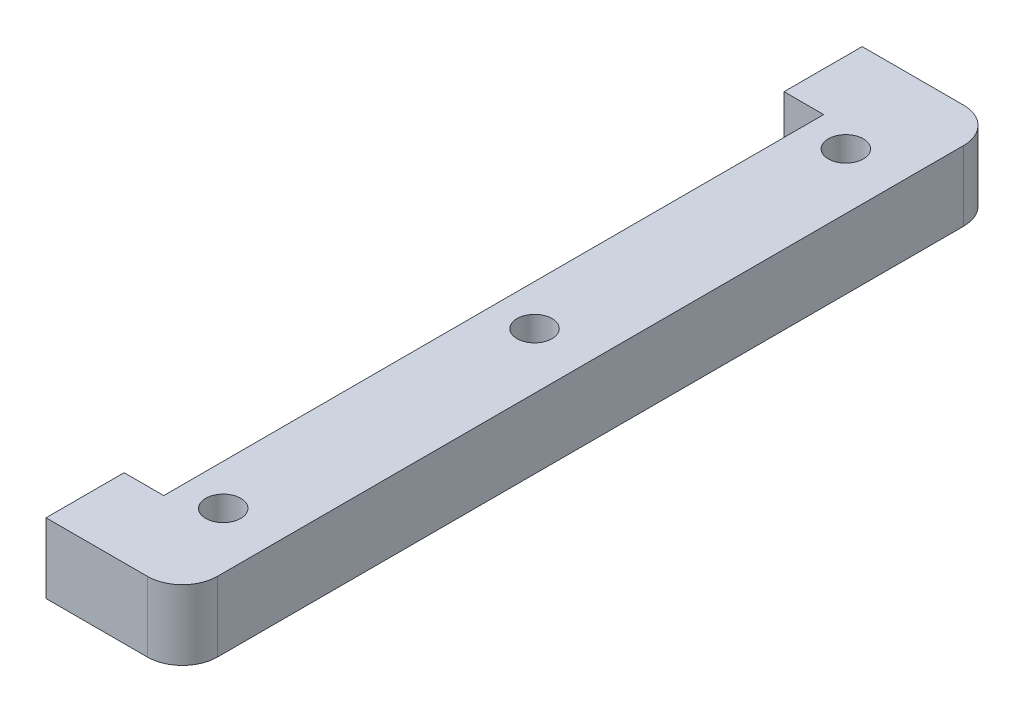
ISO-10303-21;
HEADER;
FILE_DESCRIPTION(('STEP AP214'),'2;1');
FILE_NAME('part.step','',(''),(''),'','','');
FILE_SCHEMA(('AUTOMOTIVE_DESIGN { 1 0 10303 214 1 1 1 1 }'));
ENDSEC;
DATA;
#1=APPLICATION_CONTEXT('core data for automotive mechanical design processes');
#2=APPLICATION_PROTOCOL_DEFINITION('international standard','automotive_design',2000,#1);
#3=PRODUCT_CONTEXT('',#1,'mechanical');
#4=PRODUCT('Part','Part','',(#3));
#5=PRODUCT_RELATED_PRODUCT_CATEGORY('part','',(#4));
#6=PRODUCT_DEFINITION_FORMATION('','',#4);
#7=PRODUCT_DEFINITION_CONTEXT('part definition',#1,'design');
#8=PRODUCT_DEFINITION('design','',#6,#7);
#9=PRODUCT_DEFINITION_SHAPE('','',#8);
#10=(LENGTH_UNIT() NAMED_UNIT(*) SI_UNIT(.MILLI.,.METRE.));
#11=(NAMED_UNIT(*) PLANE_ANGLE_UNIT() SI_UNIT($,.RADIAN.));
#12=(NAMED_UNIT(*) SI_UNIT($,.STERADIAN.) SOLID_ANGLE_UNIT());
#13=UNCERTAINTY_MEASURE_WITH_UNIT(LENGTH_MEASURE(1.E-05),#10,'distance_accuracy_value','');
#14=(GEOMETRIC_REPRESENTATION_CONTEXT(3) GLOBAL_UNCERTAINTY_ASSIGNED_CONTEXT((#13)) GLOBAL_UNIT_ASSIGNED_CONTEXT((#10,
#11,#12)) REPRESENTATION_CONTEXT('',''));
#15=CARTESIAN_POINT('',(0.,0.,0.));
#16=DIRECTION('',(0.,0.,1.));
#17=DIRECTION('',(1.,0.,0.));
#18=AXIS2_PLACEMENT_3D('',#15,#16,#17);
#19=CARTESIAN_POINT('',(0.,3.,0.));
#20=DIRECTION('',(0.,1.,0.));
#21=DIRECTION('',(0.,0.,1.));
#22=AXIS2_PLACEMENT_3D('',#19,#20,#21);
#23=PLANE('',#22);
#24=CARTESIAN_POINT('',(14.,3.,26.7));
#25=DIRECTION('',(0.,1.,0.));
#26=DIRECTION('',(0.,0.,1.));
#27=AXIS2_PLACEMENT_3D('',#24,#25,#26);
#28=CIRCLE('',#27,1.5);
#29=CARTESIAN_POINT('',(14.,3.,28.2));
#30=VERTEX_POINT('',#29);
#31=EDGE_CURVE('E163',#30,#30,#28,.F.);
#32=ORIENTED_EDGE('',*,*,#31,.T.);
#33=EDGE_LOOP('',(#32));
#34=FACE_BOUND('',#33,.T.);
#35=CARTESIAN_POINT('',(14.,3.,0.));
#36=DIRECTION('',(0.,1.,0.));
#37=DIRECTION('',(0.,0.,1.));
#38=AXIS2_PLACEMENT_3D('',#35,#36,#37);
#39=CIRCLE('',#38,1.5);
#40=CARTESIAN_POINT('',(14.,3.,1.5));
#41=VERTEX_POINT('',#40);
#42=EDGE_CURVE('E166',#41,#41,#39,.F.);
#43=ORIENTED_EDGE('',*,*,#42,.T.);
#44=EDGE_LOOP('',(#43));
#45=FACE_BOUND('',#44,.T.);
#46=CARTESIAN_POINT('',(14.,3.,-26.7));
#47=DIRECTION('',(0.,1.,0.));
#48=DIRECTION('',(0.,0.,1.));
#49=AXIS2_PLACEMENT_3D('',#46,#47,#48);
#50=CIRCLE('',#49,1.5);
#51=CARTESIAN_POINT('',(14.,3.,-25.2));
#52=VERTEX_POINT('',#51);
#53=EDGE_CURVE('E169',#52,#52,#50,.F.);
#54=ORIENTED_EDGE('',*,*,#53,.T.);
#55=EDGE_LOOP('',(#54));
#56=FACE_BOUND('',#55,.T.);
#57=DIRECTION('',(1.,0.,0.));
#58=VECTOR('',#57,1.);
#59=CARTESIAN_POINT('',(7.1,3.,35.));
#60=LINE('',#59,#58);
#61=CARTESIAN_POINT('',(15.8,3.,35.));
#62=VERTEX_POINT('',#61);
#63=CARTESIAN_POINT('',(7.1,3.,35.));
#64=VERTEX_POINT('',#63);
#65=EDGE_CURVE('E105',#62,#64,#60,.F.);
#66=ORIENTED_EDGE('',*,*,#65,.F.);
#67=CARTESIAN_POINT('',(15.8,3.,32.));
#68=DIRECTION('',(0.,1.,0.));
#69=DIRECTION('',(0.,0.,1.));
#70=AXIS2_PLACEMENT_3D('',#67,#68,#69);
#71=CIRCLE('',#70,3.);
#72=CARTESIAN_POINT('',(18.8,3.,32.));
#73=VERTEX_POINT('',#72);
#74=EDGE_CURVE('E20',#73,#62,#71,.F.);
#75=ORIENTED_EDGE('',*,*,#74,.F.);
#76=DIRECTION('',(0.,0.,-1.));
#77=VECTOR('',#76,1.);
#78=CARTESIAN_POINT('',(18.8,3.,32.));
#79=LINE('',#78,#77);
#80=CARTESIAN_POINT('',(18.8,3.,-32.));
#81=VERTEX_POINT('',#80);
#82=EDGE_CURVE('E91',#81,#73,#79,.F.);
#83=ORIENTED_EDGE('',*,*,#82,.F.);
#84=CARTESIAN_POINT('',(15.8,3.,-32.));
#85=DIRECTION('',(0.,1.,0.));
#86=DIRECTION('',(0.,0.,1.));
#87=AXIS2_PLACEMENT_3D('',#84,#85,#86);
#88=CIRCLE('',#87,3.);
#89=CARTESIAN_POINT('',(15.8,3.,-35.));
#90=VERTEX_POINT('',#89);
#91=EDGE_CURVE('E112',#90,#81,#88,.F.);
#92=ORIENTED_EDGE('',*,*,#91,.F.);
#93=DIRECTION('',(-1.,0.,0.));
#94=VECTOR('',#93,1.);
#95=CARTESIAN_POINT('',(15.8,3.,-35.));
#96=LINE('',#95,#94);
#97=CARTESIAN_POINT('',(7.1,3.,-35.));
#98=VERTEX_POINT('',#97);
#99=EDGE_CURVE('E147',#98,#90,#96,.F.);
#100=ORIENTED_EDGE('',*,*,#99,.F.);
#101=DIRECTION('',(0.,0.,1.));
#102=VECTOR('',#101,1.);
#103=CARTESIAN_POINT('',(7.1,3.,-35.));
#104=LINE('',#103,#102);
#105=CARTESIAN_POINT('',(7.1,3.,-28.3));
#106=VERTEX_POINT('',#105);
#107=EDGE_CURVE('E142',#106,#98,#104,.F.);
#108=ORIENTED_EDGE('',*,*,#107,.F.);
#109=DIRECTION('',(1.,0.,0.));
#110=VECTOR('',#109,1.);
#111=CARTESIAN_POINT('',(7.1,3.,-28.3));
#112=LINE('',#111,#110);
#113=CARTESIAN_POINT('',(10.5,3.,-28.3));
#114=VERTEX_POINT('',#113);
#115=EDGE_CURVE('E137',#114,#106,#112,.F.);
#116=ORIENTED_EDGE('',*,*,#115,.F.);
#117=DIRECTION('',(0.,0.,1.));
#118=VECTOR('',#117,1.);
#119=CARTESIAN_POINT('',(10.5,3.,-28.3));
#120=LINE('',#119,#118);
#121=CARTESIAN_POINT('',(10.5,3.,28.3));
#122=VERTEX_POINT('',#121);
#123=EDGE_CURVE('E132',#122,#114,#120,.F.);
#124=ORIENTED_EDGE('',*,*,#123,.F.);
#125=DIRECTION('',(-1.,0.,0.));
#126=VECTOR('',#125,1.);
#127=CARTESIAN_POINT('',(10.5,3.,28.3));
#128=LINE('',#127,#126);
#129=CARTESIAN_POINT('',(7.1,3.,28.3));
#130=VERTEX_POINT('',#129);
#131=EDGE_CURVE('E127',#130,#122,#128,.F.);
#132=ORIENTED_EDGE('',*,*,#131,.F.);
#133=DIRECTION('',(0.,0.,1.));
#134=VECTOR('',#133,1.);
#135=CARTESIAN_POINT('',(7.1,3.,28.3));
#136=LINE('',#135,#134);
#137=EDGE_CURVE('E117',#64,#130,#136,.F.);
#138=ORIENTED_EDGE('',*,*,#137,.F.);
#139=EDGE_LOOP('',(#66,#75,#83,#92,#100,#108,#116,#124,#132,#138));
#140=FACE_BOUND('',#139,.T.);
#141=ADVANCED_FACE('F17',(#34,#45,#56,#140),#23,.T.);
#142=CARTESIAN_POINT('',(15.8,-3.,32.));
#143=DIRECTION('',(0.,1.,0.));
#144=DIRECTION('',(0.,0.,1.));
#145=AXIS2_PLACEMENT_3D('',#142,#143,#144);
#146=CYLINDRICAL_SURFACE('',#145,3.);
#147=DIRECTION('',(0.,1.,0.));
#148=VECTOR('',#147,1.);
#149=CARTESIAN_POINT('',(15.8,-3.,35.));
#150=LINE('',#149,#148);
#151=CARTESIAN_POINT('',(15.8,-3.,35.));
#152=VERTEX_POINT('',#151);
#153=EDGE_CURVE('E124',#152,#62,#150,.T.);
#154=ORIENTED_EDGE('',*,*,#153,.F.);
#155=CARTESIAN_POINT('',(15.8,-3.,32.));
#156=DIRECTION('',(0.,1.,0.));
#157=DIRECTION('',(0.,0.,1.));
#158=AXIS2_PLACEMENT_3D('',#155,#156,#157);
#159=CIRCLE('',#158,3.);
#160=CARTESIAN_POINT('',(18.8,-3.,32.));
#161=VERTEX_POINT('',#160);
#162=EDGE_CURVE('E111',#152,#161,#159,.T.);
#163=ORIENTED_EDGE('',*,*,#162,.T.);
#164=DIRECTION('',(0.,1.,0.));
#165=VECTOR('',#164,1.);
#166=CARTESIAN_POINT('',(18.8,-3.,32.));
#167=LINE('',#166,#165);
#168=EDGE_CURVE('E96',#73,#161,#167,.F.);
#169=ORIENTED_EDGE('',*,*,#168,.F.);
#170=ORIENTED_EDGE('',*,*,#74,.T.);
#171=EDGE_LOOP('',(#154,#163,#169,#170));
#172=FACE_BOUND('',#171,.T.);
#173=ADVANCED_FACE('F110',(#172),#146,.T.);
#174=CARTESIAN_POINT('',(18.8,-3.,32.));
#175=DIRECTION('',(1.,0.,0.));
#176=DIRECTION('',(0.,0.,-1.));
#177=AXIS2_PLACEMENT_3D('',#174,#175,#176);
#178=PLANE('',#177);
#179=ORIENTED_EDGE('',*,*,#168,.T.);
#180=DIRECTION('',(0.,0.,1.));
#181=VECTOR('',#180,1.);
#182=CARTESIAN_POINT('',(18.8,-3.,0.));
#183=LINE('',#182,#181);
#184=CARTESIAN_POINT('',(18.8,-3.,-32.));
#185=VERTEX_POINT('',#184);
#186=EDGE_CURVE('E161',#161,#185,#183,.F.);
#187=ORIENTED_EDGE('',*,*,#186,.T.);
#188=DIRECTION('',(0.,1.,0.));
#189=VECTOR('',#188,1.);
#190=CARTESIAN_POINT('',(18.8,-3.,-32.));
#191=LINE('',#190,#189);
#192=EDGE_CURVE('E98',#81,#185,#191,.F.);
#193=ORIENTED_EDGE('',*,*,#192,.F.);
#194=ORIENTED_EDGE('',*,*,#82,.T.);
#195=EDGE_LOOP('',(#179,#187,#193,#194));
#196=FACE_BOUND('',#195,.T.);
#197=ADVANCED_FACE('F93',(#196),#178,.T.);
#198=CARTESIAN_POINT('',(15.8,-3.,-32.));
#199=DIRECTION('',(0.,1.,0.));
#200=DIRECTION('',(0.,0.,1.));
#201=AXIS2_PLACEMENT_3D('',#198,#199,#200);
#202=CYLINDRICAL_SURFACE('',#201,3.);
#203=ORIENTED_EDGE('',*,*,#192,.T.);
#204=CARTESIAN_POINT('',(15.8,-3.,-32.));
#205=DIRECTION('',(0.,1.,0.));
#206=DIRECTION('',(0.,0.,1.));
#207=AXIS2_PLACEMENT_3D('',#204,#205,#206);
#208=CIRCLE('',#207,3.);
#209=CARTESIAN_POINT('',(15.8,-3.,-35.));
#210=VERTEX_POINT('',#209);
#211=EDGE_CURVE('E157',#185,#210,#208,.T.);
#212=ORIENTED_EDGE('',*,*,#211,.T.);
#213=DIRECTION('',(0.,1.,0.));
#214=VECTOR('',#213,1.);
#215=CARTESIAN_POINT('',(15.8,-3.,-35.));
#216=LINE('',#215,#214);
#217=EDGE_CURVE('E144',#90,#210,#216,.F.);
#218=ORIENTED_EDGE('',*,*,#217,.F.);
#219=ORIENTED_EDGE('',*,*,#91,.T.);
#220=EDGE_LOOP('',(#203,#212,#218,#219));
#221=FACE_BOUND('',#220,.T.);
#222=ADVANCED_FACE('F233',(#221),#202,.T.);
#223=CARTESIAN_POINT('',(15.8,-3.,-35.));
#224=DIRECTION('',(0.,0.,-1.));
#225=DIRECTION('',(-1.,0.,0.));
#226=AXIS2_PLACEMENT_3D('',#223,#224,#225);
#227=PLANE('',#226);
#228=ORIENTED_EDGE('',*,*,#217,.T.);
#229=DIRECTION('',(1.,0.,0.));
#230=VECTOR('',#229,1.);
#231=CARTESIAN_POINT('',(0.,-3.,-35.));
#232=LINE('',#231,#230);
#233=CARTESIAN_POINT('',(7.1,-3.,-35.));
#234=VERTEX_POINT('',#233);
#235=EDGE_CURVE('E160',#210,#234,#232,.F.);
#236=ORIENTED_EDGE('',*,*,#235,.T.);
#237=DIRECTION('',(0.,1.,0.));
#238=VECTOR('',#237,1.);
#239=CARTESIAN_POINT('',(7.1,-3.,-35.));
#240=LINE('',#239,#238);
#241=EDGE_CURVE('E139',#98,#234,#240,.F.);
#242=ORIENTED_EDGE('',*,*,#241,.F.);
#243=ORIENTED_EDGE('',*,*,#99,.T.);
#244=EDGE_LOOP('',(#228,#236,#242,#243));
#245=FACE_BOUND('',#244,.T.);
#246=ADVANCED_FACE('F222',(#245),#227,.T.);
#247=CARTESIAN_POINT('',(7.1,-3.,-35.));
#248=DIRECTION('',(-1.,0.,0.));
#249=DIRECTION('',(0.,0.,1.));
#250=AXIS2_PLACEMENT_3D('',#247,#248,#249);
#251=PLANE('',#250);
#252=ORIENTED_EDGE('',*,*,#241,.T.);
#253=DIRECTION('',(0.,0.,1.));
#254=VECTOR('',#253,1.);
#255=CARTESIAN_POINT('',(7.1,-3.,0.));
#256=LINE('',#255,#254);
#257=CARTESIAN_POINT('',(7.1,-3.,-28.3));
#258=VERTEX_POINT('',#257);
#259=EDGE_CURVE('E206',#234,#258,#256,.T.);
#260=ORIENTED_EDGE('',*,*,#259,.T.);
#261=DIRECTION('',(0.,1.,0.));
#262=VECTOR('',#261,1.);
#263=CARTESIAN_POINT('',(7.1,-3.,-28.3));
#264=LINE('',#263,#262);
#265=EDGE_CURVE('E134',#106,#258,#264,.F.);
#266=ORIENTED_EDGE('',*,*,#265,.F.);
#267=ORIENTED_EDGE('',*,*,#107,.T.);
#268=EDGE_LOOP('',(#252,#260,#266,#267));
#269=FACE_BOUND('',#268,.T.);
#270=ADVANCED_FACE('F238',(#269),#251,.T.);
#271=CARTESIAN_POINT('',(7.1,-3.,-28.3));
#272=DIRECTION('',(0.,0.,1.));
#273=DIRECTION('',(1.,0.,0.));
#274=AXIS2_PLACEMENT_3D('',#271,#272,#273);
#275=PLANE('',#274);
#276=ORIENTED_EDGE('',*,*,#265,.T.);
#277=DIRECTION('',(1.,0.,0.));
#278=VECTOR('',#277,1.);
#279=CARTESIAN_POINT('',(0.,-3.,-28.3));
#280=LINE('',#279,#278);
#281=CARTESIAN_POINT('',(10.5,-3.,-28.3));
#282=VERTEX_POINT('',#281);
#283=EDGE_CURVE('E198',#258,#282,#280,.T.);
#284=ORIENTED_EDGE('',*,*,#283,.T.);
#285=DIRECTION('',(0.,1.,0.));
#286=VECTOR('',#285,1.);
#287=CARTESIAN_POINT('',(10.5,-3.,-28.3));
#288=LINE('',#287,#286);
#289=EDGE_CURVE('E129',#114,#282,#288,.F.);
#290=ORIENTED_EDGE('',*,*,#289,.F.);
#291=ORIENTED_EDGE('',*,*,#115,.T.);
#292=EDGE_LOOP('',(#276,#284,#290,#291));
#293=FACE_BOUND('',#292,.T.);
#294=ADVANCED_FACE('F240',(#293),#275,.T.);
#295=CARTESIAN_POINT('',(10.5,-3.,-28.3));
#296=DIRECTION('',(-1.,0.,0.));
#297=DIRECTION('',(0.,0.,1.));
#298=AXIS2_PLACEMENT_3D('',#295,#296,#297);
#299=PLANE('',#298);
#300=ORIENTED_EDGE('',*,*,#289,.T.);
#301=DIRECTION('',(0.,0.,1.));
#302=VECTOR('',#301,1.);
#303=CARTESIAN_POINT('',(10.5,-3.,0.));
#304=LINE('',#303,#302);
#305=CARTESIAN_POINT('',(10.5,-3.,28.3));
#306=VERTEX_POINT('',#305);
#307=EDGE_CURVE('E190',#282,#306,#304,.T.);
#308=ORIENTED_EDGE('',*,*,#307,.T.);
#309=DIRECTION('',(0.,1.,0.));
#310=VECTOR('',#309,1.);
#311=CARTESIAN_POINT('',(10.5,-3.,28.3));
#312=LINE('',#311,#310);
#313=EDGE_CURVE('E120',#122,#306,#312,.F.);
#314=ORIENTED_EDGE('',*,*,#313,.F.);
#315=ORIENTED_EDGE('',*,*,#123,.T.);
#316=EDGE_LOOP('',(#300,#308,#314,#315));
#317=FACE_BOUND('',#316,.T.);
#318=ADVANCED_FACE('F246',(#317),#299,.T.);
#319=CARTESIAN_POINT('',(10.5,-3.,28.3));
#320=DIRECTION('',(0.,0.,-1.));
#321=DIRECTION('',(-1.,0.,0.));
#322=AXIS2_PLACEMENT_3D('',#319,#320,#321);
#323=PLANE('',#322);
#324=ORIENTED_EDGE('',*,*,#313,.T.);
#325=DIRECTION('',(1.,0.,0.));
#326=VECTOR('',#325,1.);
#327=CARTESIAN_POINT('',(0.,-3.,28.3));
#328=LINE('',#327,#326);
#329=CARTESIAN_POINT('',(7.1,-3.,28.3));
#330=VERTEX_POINT('',#329);
#331=EDGE_CURVE('E182',#306,#330,#328,.F.);
#332=ORIENTED_EDGE('',*,*,#331,.T.);
#333=DIRECTION('',(0.,1.,0.));
#334=VECTOR('',#333,1.);
#335=CARTESIAN_POINT('',(7.1,-3.,28.3));
#336=LINE('',#335,#334);
#337=EDGE_CURVE('E119',#130,#330,#336,.F.);
#338=ORIENTED_EDGE('',*,*,#337,.F.);
#339=ORIENTED_EDGE('',*,*,#131,.T.);
#340=EDGE_LOOP('',(#324,#332,#338,#339));
#341=FACE_BOUND('',#340,.T.);
#342=ADVANCED_FACE('F251',(#341),#323,.T.);
#343=CARTESIAN_POINT('',(7.1,-3.,28.3));
#344=DIRECTION('',(-1.,0.,0.));
#345=DIRECTION('',(0.,0.,1.));
#346=AXIS2_PLACEMENT_3D('',#343,#344,#345);
#347=PLANE('',#346);
#348=ORIENTED_EDGE('',*,*,#337,.T.);
#349=DIRECTION('',(0.,0.,1.));
#350=VECTOR('',#349,1.);
#351=CARTESIAN_POINT('',(7.1,-3.,0.));
#352=LINE('',#351,#350);
#353=CARTESIAN_POINT('',(7.1,-3.,35.));
#354=VERTEX_POINT('',#353);
#355=EDGE_CURVE('E179',#330,#354,#352,.T.);
#356=ORIENTED_EDGE('',*,*,#355,.T.);
#357=DIRECTION('',(0.,1.,0.));
#358=VECTOR('',#357,1.);
#359=CARTESIAN_POINT('',(7.1,-3.,35.));
#360=LINE('',#359,#358);
#361=EDGE_CURVE('E35',#64,#354,#360,.F.);
#362=ORIENTED_EDGE('',*,*,#361,.F.);
#363=ORIENTED_EDGE('',*,*,#137,.T.);
#364=EDGE_LOOP('',(#348,#356,#362,#363));
#365=FACE_BOUND('',#364,.T.);
#366=ADVANCED_FACE('F253',(#365),#347,.T.);
#367=CARTESIAN_POINT('',(7.1,-3.,35.));
#368=DIRECTION('',(0.,0.,1.));
#369=DIRECTION('',(1.,0.,0.));
#370=AXIS2_PLACEMENT_3D('',#367,#368,#369);
#371=PLANE('',#370);
#372=ORIENTED_EDGE('',*,*,#361,.T.);
#373=DIRECTION('',(1.,0.,0.));
#374=VECTOR('',#373,1.);
#375=CARTESIAN_POINT('',(0.,-3.,35.));
#376=LINE('',#375,#374);
#377=EDGE_CURVE('E156',#354,#152,#376,.T.);
#378=ORIENTED_EDGE('',*,*,#377,.T.);
#379=ORIENTED_EDGE('',*,*,#153,.T.);
#380=ORIENTED_EDGE('',*,*,#65,.T.);
#381=EDGE_LOOP('',(#372,#378,#379,#380));
#382=FACE_BOUND('',#381,.T.);
#383=ADVANCED_FACE('F259',(#382),#371,.T.);
#384=CARTESIAN_POINT('',(14.,-3.,-26.7));
#385=DIRECTION('',(0.,1.,0.));
#386=DIRECTION('',(0.,0.,1.));
#387=AXIS2_PLACEMENT_3D('',#384,#385,#386);
#388=CYLINDRICAL_SURFACE('',#387,1.5);
#389=ORIENTED_EDGE('',*,*,#53,.F.);
#390=EDGE_LOOP('',(#389));
#391=FACE_BOUND('',#390,.T.);
#392=CARTESIAN_POINT('',(14.,-3.,-26.7));
#393=DIRECTION('',(0.,1.,0.));
#394=DIRECTION('',(0.,0.,1.));
#395=AXIS2_PLACEMENT_3D('',#392,#393,#394);
#396=CIRCLE('',#395,1.5);
#397=CARTESIAN_POINT('',(14.,-3.,-25.2));
#398=VERTEX_POINT('',#397);
#399=EDGE_CURVE('E153',#398,#398,#396,.F.);
#400=ORIENTED_EDGE('',*,*,#399,.T.);
#401=EDGE_LOOP('',(#400));
#402=FACE_BOUND('',#401,.T.);
#403=ADVANCED_FACE('F261',(#391,#402),#388,.F.);
#404=CARTESIAN_POINT('',(14.,-3.,0.));
#405=DIRECTION('',(0.,1.,0.));
#406=DIRECTION('',(0.,0.,1.));
#407=AXIS2_PLACEMENT_3D('',#404,#405,#406);
#408=CYLINDRICAL_SURFACE('',#407,1.5);
#409=ORIENTED_EDGE('',*,*,#42,.F.);
#410=EDGE_LOOP('',(#409));
#411=FACE_BOUND('',#410,.T.);
#412=CARTESIAN_POINT('',(14.,-3.,0.));
#413=DIRECTION('',(0.,1.,0.));
#414=DIRECTION('',(0.,0.,1.));
#415=AXIS2_PLACEMENT_3D('',#412,#413,#414);
#416=CIRCLE('',#415,1.5);
#417=CARTESIAN_POINT('',(14.,-3.,1.5));
#418=VERTEX_POINT('',#417);
#419=EDGE_CURVE('E26',#418,#418,#416,.F.);
#420=ORIENTED_EDGE('',*,*,#419,.T.);
#421=EDGE_LOOP('',(#420));
#422=FACE_BOUND('',#421,.T.);
#423=ADVANCED_FACE('F268',(#411,#422),#408,.F.);
#424=CARTESIAN_POINT('',(14.,-3.,26.7));
#425=DIRECTION('',(0.,1.,0.));
#426=DIRECTION('',(0.,0.,1.));
#427=AXIS2_PLACEMENT_3D('',#424,#425,#426);
#428=CYLINDRICAL_SURFACE('',#427,1.5);
#429=ORIENTED_EDGE('',*,*,#31,.F.);
#430=EDGE_LOOP('',(#429));
#431=FACE_BOUND('',#430,.T.);
#432=CARTESIAN_POINT('',(14.,-3.,26.7));
#433=DIRECTION('',(0.,1.,0.));
#434=DIRECTION('',(0.,0.,1.));
#435=AXIS2_PLACEMENT_3D('',#432,#433,#434);
#436=CIRCLE('',#435,1.5);
#437=CARTESIAN_POINT('',(14.,-3.,28.2));
#438=VERTEX_POINT('',#437);
#439=EDGE_CURVE('E11',#438,#438,#436,.F.);
#440=ORIENTED_EDGE('',*,*,#439,.T.);
#441=EDGE_LOOP('',(#440));
#442=FACE_BOUND('',#441,.T.);
#443=ADVANCED_FACE('F273',(#431,#442),#428,.F.);
#444=CARTESIAN_POINT('',(0.,-3.,0.));
#445=DIRECTION('',(0.,1.,0.));
#446=DIRECTION('',(0.,0.,1.));
#447=AXIS2_PLACEMENT_3D('',#444,#445,#446);
#448=PLANE('',#447);
#449=ORIENTED_EDGE('',*,*,#439,.F.);
#450=EDGE_LOOP('',(#449));
#451=FACE_BOUND('',#450,.T.);
#452=ORIENTED_EDGE('',*,*,#419,.F.);
#453=EDGE_LOOP('',(#452));
#454=FACE_BOUND('',#453,.T.);
#455=ORIENTED_EDGE('',*,*,#399,.F.);
#456=EDGE_LOOP('',(#455));
#457=FACE_BOUND('',#456,.T.);
#458=ORIENTED_EDGE('',*,*,#355,.F.);
#459=ORIENTED_EDGE('',*,*,#331,.F.);
#460=ORIENTED_EDGE('',*,*,#307,.F.);
#461=ORIENTED_EDGE('',*,*,#283,.F.);
#462=ORIENTED_EDGE('',*,*,#259,.F.);
#463=ORIENTED_EDGE('',*,*,#235,.F.);
#464=ORIENTED_EDGE('',*,*,#211,.F.);
#465=ORIENTED_EDGE('',*,*,#186,.F.);
#466=ORIENTED_EDGE('',*,*,#162,.F.);
#467=ORIENTED_EDGE('',*,*,#377,.F.);
#468=EDGE_LOOP('',(#458,#459,#460,#461,#462,#463,#464,#465,#466,#467));
#469=FACE_BOUND('',#468,.T.);
#470=ADVANCED_FACE('F230',(#451,#454,#457,#469),#448,.F.);
#471=CLOSED_SHELL('',(#141,#173,#197,#222,#246,#270,#294,#318,#342,#366,#383,#403,#423,#443,#470));
#472=MANIFOLD_SOLID_BREP('B1',#471);
#473=ADVANCED_BREP_SHAPE_REPRESENTATION('',(#18,#472),#14);
#474=SHAPE_DEFINITION_REPRESENTATION(#9,#473);
ENDSEC;
END-ISO-10303-21;
